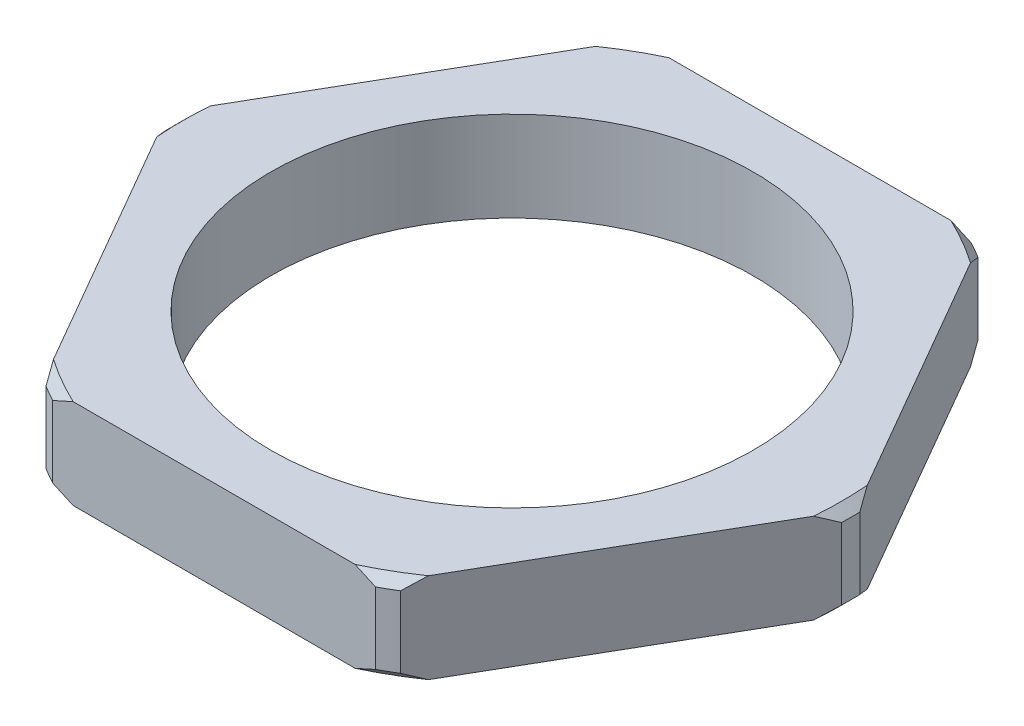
ISO-10303-21;
HEADER;
FILE_DESCRIPTION(('STEP AP214'),'2;1');
FILE_NAME('part.step','',(''),(''),'','','');
FILE_SCHEMA(('AUTOMOTIVE_DESIGN { 1 0 10303 214 1 1 1 1 }'));
ENDSEC;
DATA;
#1=APPLICATION_CONTEXT('core data for automotive mechanical design processes');
#2=APPLICATION_PROTOCOL_DEFINITION('international standard','automotive_design',2000,#1);
#3=PRODUCT_CONTEXT('',#1,'mechanical');
#4=PRODUCT('Part','Part','',(#3));
#5=PRODUCT_RELATED_PRODUCT_CATEGORY('part','',(#4));
#6=PRODUCT_DEFINITION_FORMATION('','',#4);
#7=PRODUCT_DEFINITION_CONTEXT('part definition',#1,'design');
#8=PRODUCT_DEFINITION('design','',#6,#7);
#9=PRODUCT_DEFINITION_SHAPE('','',#8);
#10=(LENGTH_UNIT() NAMED_UNIT(*) SI_UNIT(.MILLI.,.METRE.));
#11=(NAMED_UNIT(*) PLANE_ANGLE_UNIT() SI_UNIT($,.RADIAN.));
#12=(NAMED_UNIT(*) SI_UNIT($,.STERADIAN.) SOLID_ANGLE_UNIT());
#13=UNCERTAINTY_MEASURE_WITH_UNIT(LENGTH_MEASURE(1.E-05),#10,'distance_accuracy_value','');
#14=(GEOMETRIC_REPRESENTATION_CONTEXT(3) GLOBAL_UNCERTAINTY_ASSIGNED_CONTEXT((#13)) GLOBAL_UNIT_ASSIGNED_CONTEXT((#10,
#11,#12)) REPRESENTATION_CONTEXT('',''));
#15=CARTESIAN_POINT('',(0.,0.,0.));
#16=DIRECTION('',(0.,0.,1.));
#17=DIRECTION('',(1.,0.,0.));
#18=AXIS2_PLACEMENT_3D('',#15,#16,#17);
#19=CARTESIAN_POINT('',(0.,0.514706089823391,0.));
#20=DIRECTION('',(0.,1.,0.));
#21=DIRECTION('',(-1.,0.,0.));
#22=AXIS2_PLACEMENT_3D('',#19,#20,#21);
#23=CONICAL_SURFACE('',#22,18.825,0.78539816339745);
#24=CARTESIAN_POINT('',(18.8182004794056,0.514706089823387,0.505920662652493));
#25=CARTESIAN_POINT('',(18.7712355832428,0.469944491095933,0.587266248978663));
#26=CARTESIAN_POINT('',(18.7241650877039,0.42562525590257,0.66879473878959));
#27=CARTESIAN_POINT('',(18.6298148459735,0.337912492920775,0.832214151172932));
#28=CARTESIAN_POINT('',(18.5825351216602,0.294518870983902,0.914105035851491));
#29=CARTESIAN_POINT('',(18.4877585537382,0.208688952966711,1.07826286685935));
#30=CARTESIAN_POINT('',(18.4402617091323,0.166252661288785,1.16052981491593));
#31=CARTESIAN_POINT('',(18.3450438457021,0.0823717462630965,1.32545199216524));
#32=CARTESIAN_POINT('',(18.2973228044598,0.0409272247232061,1.40810726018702));
#33=CARTESIAN_POINT('',(18.2494908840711,0.,1.49095457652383));
#34=B_SPLINE_CURVE_WITH_KNOTS('',3,(#24,#25,#26,#27,#28,#29,#30,#31,#32,#33),.UNSPECIFIED.,.F.,
.F.,(4,2,2,2,4),(0.,0.312149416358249,0.624266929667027,0.936385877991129,1.24853672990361),.UNSPECIFIED.);
#35=CARTESIAN_POINT('',(18.8182004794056,0.514706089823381,0.505920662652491));
#36=VERTEX_POINT('',#35);
#37=CARTESIAN_POINT('',(18.2494908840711,0.,1.49095457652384));
#38=VERTEX_POINT('',#37);
#39=EDGE_CURVE('E189',#36,#38,#34,.T.);
#40=ORIENTED_EDGE('',*,*,#39,.T.);
#41=CARTESIAN_POINT('',(0.,0.,0.));
#42=DIRECTION('',(0.,1.,0.));
#43=DIRECTION('',(-1.,0.,0.));
#44=AXIS2_PLACEMENT_3D('',#41,#42,#43);
#45=CIRCLE('',#44,18.3102939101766);
#46=CARTESIAN_POINT('',(18.2494908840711,0.,-1.4909545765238));
#47=VERTEX_POINT('',#46);
#48=EDGE_CURVE('E187',#38,#47,#45,.T.);
#49=ORIENTED_EDGE('',*,*,#48,.T.);
#50=CARTESIAN_POINT('',(18.2494908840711,0.,-1.49095457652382));
#51=CARTESIAN_POINT('',(18.2973228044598,0.0409272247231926,-1.408107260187));
#52=CARTESIAN_POINT('',(18.3450438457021,0.0823717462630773,-1.32545199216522));
#53=CARTESIAN_POINT('',(18.4402617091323,0.166252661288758,-1.16052981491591));
#54=CARTESIAN_POINT('',(18.4877585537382,0.208688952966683,-1.07826286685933));
#55=CARTESIAN_POINT('',(18.5825351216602,0.294518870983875,-0.914105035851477));
#56=CARTESIAN_POINT('',(18.6298148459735,0.337912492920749,-0.832214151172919));
#57=CARTESIAN_POINT('',(18.7241650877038,0.425625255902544,-0.668794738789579));
#58=CARTESIAN_POINT('',(18.7712355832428,0.469944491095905,-0.587266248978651));
#59=CARTESIAN_POINT('',(18.8182004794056,0.514706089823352,-0.505920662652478));
#60=B_SPLINE_CURVE_WITH_KNOTS('',3,(#50,#51,#52,#53,#54,#55,#56,#57,#58,#59),.UNSPECIFIED.,.F.,
.F.,(4,2,2,2,4),(0.,0.312150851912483,0.624269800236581,0.936387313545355,1.2485367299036),.UNSPECIFIED.);
#61=CARTESIAN_POINT('',(18.8182004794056,0.514706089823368,-0.505920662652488));
#62=VERTEX_POINT('',#61);
#63=EDGE_CURVE('E21',#47,#62,#60,.T.);
#64=ORIENTED_EDGE('',*,*,#63,.T.);
#65=CARTESIAN_POINT('',(0.,0.514706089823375,0.));
#66=DIRECTION('',(0.,1.,0.));
#67=DIRECTION('',(0.,0.,1.));
#68=AXIS2_PLACEMENT_3D('',#65,#66,#67);
#69=CIRCLE('',#68,18.825);
#70=EDGE_CURVE('E184',#36,#62,#69,.T.);
#71=ORIENTED_EDGE('',*,*,#70,.F.);
#72=EDGE_LOOP('',(#40,#49,#64,#71));
#73=FACE_BOUND('',#72,.T.);
#74=ADVANCED_FACE('F17',(#73),#23,.T.);
#75=CARTESIAN_POINT('',(0.,0.514706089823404,0.));
#76=DIRECTION('',(0.,1.,0.));
#77=DIRECTION('',(0.,0.,1.));
#78=AXIS2_PLACEMENT_3D('',#75,#76,#77);
#79=CONICAL_SURFACE('',#78,18.825,0.785398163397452);
#80=CARTESIAN_POINT('',(9.84724038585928,0.514706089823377,-16.0440793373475));
#81=CARTESIAN_POINT('',(9.89420528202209,0.469944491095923,-15.9627337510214));
#82=CARTESIAN_POINT('',(9.94127577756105,0.425625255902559,-15.8812052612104));
#83=CARTESIAN_POINT('',(10.0356260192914,0.33791249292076,-15.7177858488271));
#84=CARTESIAN_POINT('',(10.0829057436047,0.294518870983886,-15.6358949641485));
#85=CARTESIAN_POINT('',(10.1776823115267,0.208688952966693,-15.4717371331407));
#86=CARTESIAN_POINT('',(10.2251791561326,0.166252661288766,-15.3894701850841));
#87=CARTESIAN_POINT('',(10.3203970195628,0.0823717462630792,-15.2245480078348));
#88=CARTESIAN_POINT('',(10.3681180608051,0.0409272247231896,-15.141892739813));
#89=CARTESIAN_POINT('',(10.4159499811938,0.,-15.0590454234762));
#90=B_SPLINE_CURVE_WITH_KNOTS('',3,(#80,#81,#82,#83,#84,#85,#86,#87,#88,#89),.UNSPECIFIED.,.F.,
.F.,(4,2,2,2,4),(0.,0.312149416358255,0.624266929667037,0.936385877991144,1.24853672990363),.UNSPECIFIED.);
#91=CARTESIAN_POINT('',(9.84724038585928,0.514706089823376,-16.0440793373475));
#92=VERTEX_POINT('',#91);
#93=CARTESIAN_POINT('',(10.4159499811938,0.,-15.0590454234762));
#94=VERTEX_POINT('',#93);
#95=EDGE_CURVE('E426',#92,#94,#90,.T.);
#96=ORIENTED_EDGE('',*,*,#95,.T.);
#97=CARTESIAN_POINT('',(0.,0.,0.));
#98=DIRECTION('',(0.,1.,0.));
#99=DIRECTION('',(0.,0.,1.));
#100=AXIS2_PLACEMENT_3D('',#97,#98,#99);
#101=CIRCLE('',#100,18.3102939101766);
#102=CARTESIAN_POINT('',(7.8335409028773,0.,-16.5499999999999));
#103=VERTEX_POINT('',#102);
#104=EDGE_CURVE('E479',#94,#103,#101,.T.);
#105=ORIENTED_EDGE('',*,*,#104,.T.);
#106=CARTESIAN_POINT('',(7.83354090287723,0.,-16.5499999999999));
#107=CARTESIAN_POINT('',(7.92920474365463,0.0409272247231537,-16.5499999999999));
#108=CARTESIAN_POINT('',(8.02464682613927,0.0823717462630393,-16.5499999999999));
#109=CARTESIAN_POINT('',(8.21508255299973,0.166252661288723,-16.5499999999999));
#110=CARTESIAN_POINT('',(8.31007624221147,0.208688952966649,-16.5499999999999));
#111=CARTESIAN_POINT('',(8.49962937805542,0.294518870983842,-16.5499999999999));
#112=CARTESIAN_POINT('',(8.5941888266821,0.337912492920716,-16.5499999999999));
#113=CARTESIAN_POINT('',(8.78288931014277,0.425625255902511,-16.5499999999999));
#114=CARTESIAN_POINT('',(8.8770303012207,0.469944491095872,-16.5499999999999));
#115=CARTESIAN_POINT('',(8.97096009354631,0.514706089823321,-16.5499999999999));
#116=B_SPLINE_CURVE_WITH_KNOTS('',3,(#106,#107,#108,#109,#110,#111,#112,#113,#114,#115),
.UNSPECIFIED.,.F.,.F.,(4,2,2,2,4),(0.,0.312150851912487,0.62426980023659,0.93638731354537,
1.24853672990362),.UNSPECIFIED.);
#117=CARTESIAN_POINT('',(8.97096009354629,0.514706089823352,-16.5499999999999));
#118=VERTEX_POINT('',#117);
#119=EDGE_CURVE('E430',#103,#118,#116,.T.);
#120=ORIENTED_EDGE('',*,*,#119,.T.);
#121=CARTESIAN_POINT('',(0.,0.514706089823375,0.));
#122=DIRECTION('',(0.,1.,0.));
#123=DIRECTION('',(0.,0.,1.));
#124=AXIS2_PLACEMENT_3D('',#121,#122,#123);
#125=CIRCLE('',#124,18.825);
#126=EDGE_CURVE('E197',#92,#118,#125,.T.);
#127=ORIENTED_EDGE('',*,*,#126,.F.);
#128=EDGE_LOOP('',(#96,#105,#120,#127));
#129=FACE_BOUND('',#128,.T.);
#130=ADVANCED_FACE('F434',(#129),#79,.T.);
#131=CARTESIAN_POINT('',(0.,0.514706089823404,0.));
#132=DIRECTION('',(0.,1.,0.));
#133=DIRECTION('',(0.,0.,1.));
#134=AXIS2_PLACEMENT_3D('',#131,#132,#133);
#135=CONICAL_SURFACE('',#134,18.825,0.785398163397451);
#136=CARTESIAN_POINT('',(-8.97096009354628,0.51470608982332,-16.5499999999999));
#137=CARTESIAN_POINT('',(-8.87703030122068,0.469944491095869,-16.5499999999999));
#138=CARTESIAN_POINT('',(-8.78288931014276,0.425625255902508,-16.5499999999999));
#139=CARTESIAN_POINT('',(-8.5941888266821,0.337912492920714,-16.5499999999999));
#140=CARTESIAN_POINT('',(-8.49962937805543,0.294518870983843,-16.5499999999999));
#141=CARTESIAN_POINT('',(-8.31007624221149,0.208688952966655,-16.5499999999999));
#142=CARTESIAN_POINT('',(-8.21508255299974,0.166252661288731,-16.5499999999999));
#143=CARTESIAN_POINT('',(-8.0246468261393,0.0823717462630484,-16.5499999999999));
#144=CARTESIAN_POINT('',(-7.92920474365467,0.0409272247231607,-16.5499999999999));
#145=CARTESIAN_POINT('',(-7.83354090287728,0.,-16.5499999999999));
#146=B_SPLINE_CURVE_WITH_KNOTS('',3,(#136,#137,#138,#139,#140,#141,#142,#143,#144,#145),
.UNSPECIFIED.,.F.,.F.,(4,2,2,2,4),(0.,0.312149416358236,0.624266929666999,0.936385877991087,
1.24853672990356),.UNSPECIFIED.);
#147=CARTESIAN_POINT('',(-8.97096009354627,0.514706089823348,-16.5499999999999));
#148=VERTEX_POINT('',#147);
#149=CARTESIAN_POINT('',(-7.83354090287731,0.,-16.5499999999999));
#150=VERTEX_POINT('',#149);
#151=EDGE_CURVE('E376',#148,#150,#146,.T.);
#152=ORIENTED_EDGE('',*,*,#151,.T.);
#153=CARTESIAN_POINT('',(0.,0.,0.));
#154=DIRECTION('',(0.,1.,0.));
#155=DIRECTION('',(0.,0.,1.));
#156=AXIS2_PLACEMENT_3D('',#153,#154,#155);
#157=CIRCLE('',#156,18.3102939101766);
#158=CARTESIAN_POINT('',(-10.4159499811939,0.,-15.0590454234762));
#159=VERTEX_POINT('',#158);
#160=EDGE_CURVE('E476',#150,#159,#157,.T.);
#161=ORIENTED_EDGE('',*,*,#160,.T.);
#162=CARTESIAN_POINT('',(-10.4159499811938,0.,-15.0590454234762));
#163=CARTESIAN_POINT('',(-10.3681180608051,0.0409272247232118,-15.141892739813));
#164=CARTESIAN_POINT('',(-10.3203970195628,0.0823717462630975,-15.2245480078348));
#165=CARTESIAN_POINT('',(-10.2251791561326,0.166252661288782,-15.3894701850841));
#166=CARTESIAN_POINT('',(-10.1776823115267,0.20868895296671,-15.4717371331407));
#167=CARTESIAN_POINT('',(-10.0829057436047,0.294518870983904,-15.6358949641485));
#168=CARTESIAN_POINT('',(-10.0356260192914,0.337912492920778,-15.7177858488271));
#169=CARTESIAN_POINT('',(-9.94127577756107,0.425625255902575,-15.8812052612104));
#170=CARTESIAN_POINT('',(-9.89420528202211,0.469944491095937,-15.9627337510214));
#171=CARTESIAN_POINT('',(-9.8472403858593,0.514706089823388,-16.0440793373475));
#172=B_SPLINE_CURVE_WITH_KNOTS('',3,(#162,#163,#164,#165,#166,#167,#168,#169,#170,#171),
.UNSPECIFIED.,.F.,.F.,(4,2,2,2,4),(0.,0.31215085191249,0.624269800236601,0.936387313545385,
1.24853672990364),.UNSPECIFIED.);
#173=CARTESIAN_POINT('',(-9.8472403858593,0.514706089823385,-16.0440793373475));
#174=VERTEX_POINT('',#173);
#175=EDGE_CURVE('E382',#159,#174,#172,.T.);
#176=ORIENTED_EDGE('',*,*,#175,.T.);
#177=CARTESIAN_POINT('',(0.,0.514706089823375,0.));
#178=DIRECTION('',(0.,1.,0.));
#179=DIRECTION('',(0.,0.,1.));
#180=AXIS2_PLACEMENT_3D('',#177,#178,#179);
#181=CIRCLE('',#180,18.825);
#182=EDGE_CURVE('E240',#148,#174,#181,.T.);
#183=ORIENTED_EDGE('',*,*,#182,.F.);
#184=EDGE_LOOP('',(#152,#161,#176,#183));
#185=FACE_BOUND('',#184,.T.);
#186=ADVANCED_FACE('F364',(#185),#135,.T.);
#187=CARTESIAN_POINT('',(0.,0.514706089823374,0.));
#188=DIRECTION('',(0.,1.,0.));
#189=DIRECTION('',(0.,0.,1.));
#190=AXIS2_PLACEMENT_3D('',#187,#188,#189);
#191=CONICAL_SURFACE('',#190,18.825,0.78539816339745);
#192=CARTESIAN_POINT('',(-18.8182004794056,0.514706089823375,-0.505920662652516));
#193=CARTESIAN_POINT('',(-18.7712355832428,0.469944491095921,-0.587266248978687));
#194=CARTESIAN_POINT('',(-18.7241650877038,0.425625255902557,-0.668794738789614));
#195=CARTESIAN_POINT('',(-18.6298148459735,0.337912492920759,-0.832214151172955));
#196=CARTESIAN_POINT('',(-18.5825351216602,0.294518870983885,-0.914105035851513));
#197=CARTESIAN_POINT('',(-18.4877585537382,0.208688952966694,-1.07826286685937));
#198=CARTESIAN_POINT('',(-18.4402617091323,0.166252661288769,-1.16052981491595));
#199=CARTESIAN_POINT('',(-18.3450438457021,0.0823717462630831,-1.32545199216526));
#200=CARTESIAN_POINT('',(-18.2973228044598,0.0409272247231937,-1.40810726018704));
#201=CARTESIAN_POINT('',(-18.2494908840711,0.,-1.49095457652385));
#202=B_SPLINE_CURVE_WITH_KNOTS('',3,(#192,#193,#194,#195,#196,#197,#198,#199,#200,#201),
.UNSPECIFIED.,.F.,.F.,(4,2,2,2,4),(0.,0.312149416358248,0.624266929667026,0.93638587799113,
1.24853672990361),.UNSPECIFIED.);
#203=CARTESIAN_POINT('',(-18.8182004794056,0.514706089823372,-0.505920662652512));
#204=VERTEX_POINT('',#203);
#205=CARTESIAN_POINT('',(-18.2494908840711,0.,-1.49095457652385));
#206=VERTEX_POINT('',#205);
#207=EDGE_CURVE('E266',#204,#206,#202,.T.);
#208=ORIENTED_EDGE('',*,*,#207,.T.);
#209=CARTESIAN_POINT('',(0.,0.,0.));
#210=DIRECTION('',(0.,1.,0.));
#211=DIRECTION('',(0.,0.,1.));
#212=AXIS2_PLACEMENT_3D('',#209,#210,#211);
#213=CIRCLE('',#212,18.3102939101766);
#214=CARTESIAN_POINT('',(-18.2494908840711,0.,1.49095457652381));
#215=VERTEX_POINT('',#214);
#216=EDGE_CURVE('E473',#206,#215,#213,.T.);
#217=ORIENTED_EDGE('',*,*,#216,.T.);
#218=CARTESIAN_POINT('',(-18.2494908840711,0.,1.49095457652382));
#219=CARTESIAN_POINT('',(-18.2973228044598,0.0409272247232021,1.40810726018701));
#220=CARTESIAN_POINT('',(-18.3450438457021,0.082371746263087,1.32545199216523));
#221=CARTESIAN_POINT('',(-18.4402617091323,0.166252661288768,1.16052981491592));
#222=CARTESIAN_POINT('',(-18.4877585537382,0.208688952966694,1.07826286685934));
#223=CARTESIAN_POINT('',(-18.5825351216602,0.294518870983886,0.914105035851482));
#224=CARTESIAN_POINT('',(-18.6298148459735,0.33791249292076,0.832214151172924));
#225=CARTESIAN_POINT('',(-18.7241650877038,0.425625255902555,0.668794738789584));
#226=CARTESIAN_POINT('',(-18.7712355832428,0.469944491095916,0.587266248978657));
#227=CARTESIAN_POINT('',(-18.8182004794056,0.514706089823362,0.505920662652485));
#228=B_SPLINE_CURVE_WITH_KNOTS('',3,(#218,#219,#220,#221,#222,#223,#224,#225,#226,#227),
.UNSPECIFIED.,.F.,.F.,(4,2,2,2,4),(0.,0.312150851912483,0.624269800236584,0.936387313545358,
1.2485367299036),.UNSPECIFIED.);
#229=CARTESIAN_POINT('',(-18.8182004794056,0.51470608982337,0.505920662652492));
#230=VERTEX_POINT('',#229);
#231=EDGE_CURVE('E267',#215,#230,#228,.T.);
#232=ORIENTED_EDGE('',*,*,#231,.T.);
#233=CARTESIAN_POINT('',(0.,0.514706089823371,0.));
#234=DIRECTION('',(0.,1.,0.));
#235=DIRECTION('',(0.,0.,1.));
#236=AXIS2_PLACEMENT_3D('',#233,#234,#235);
#237=CIRCLE('',#236,18.825);
#238=EDGE_CURVE('E264',#230,#204,#237,.F.);
#239=ORIENTED_EDGE('',*,*,#238,.T.);
#240=EDGE_LOOP('',(#208,#217,#232,#239));
#241=FACE_BOUND('',#240,.T.);
#242=ADVANCED_FACE('F356',(#241),#191,.T.);
#243=CARTESIAN_POINT('',(0.,0.514706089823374,0.));
#244=DIRECTION('',(0.,1.,0.));
#245=DIRECTION('',(0.,0.,1.));
#246=AXIS2_PLACEMENT_3D('',#243,#244,#245);
#247=CONICAL_SURFACE('',#246,18.825,0.785398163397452);
#248=CARTESIAN_POINT('',(-9.84724038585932,0.51470608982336,16.0440793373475));
#249=CARTESIAN_POINT('',(-9.89420528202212,0.469944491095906,15.9627337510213));
#250=CARTESIAN_POINT('',(-9.94127577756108,0.425625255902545,15.8812052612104));
#251=CARTESIAN_POINT('',(-10.0356260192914,0.337912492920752,15.7177858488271));
#252=CARTESIAN_POINT('',(-10.0829057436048,0.294518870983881,15.6358949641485));
#253=CARTESIAN_POINT('',(-10.1776823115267,0.208688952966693,15.4717371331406));
#254=CARTESIAN_POINT('',(-10.2251791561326,0.166252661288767,15.3894701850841));
#255=CARTESIAN_POINT('',(-10.3203970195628,0.082371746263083,15.2245480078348));
#256=CARTESIAN_POINT('',(-10.3681180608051,0.0409272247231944,15.141892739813));
#257=CARTESIAN_POINT('',(-10.4159499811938,0.,15.0590454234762));
#258=B_SPLINE_CURVE_WITH_KNOTS('',3,(#248,#249,#250,#251,#252,#253,#254,#255,#256,#257),
.UNSPECIFIED.,.F.,.F.,(4,2,2,2,4),(0.,0.312149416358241,0.624266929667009,0.936385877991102,
1.24853672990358),.UNSPECIFIED.);
#259=CARTESIAN_POINT('',(-9.84724038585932,0.514706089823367,16.0440793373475));
#260=VERTEX_POINT('',#259);
#261=CARTESIAN_POINT('',(-10.4159499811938,0.,15.0590454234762));
#262=VERTEX_POINT('',#261);
#263=EDGE_CURVE('E332',#260,#262,#258,.T.);
#264=ORIENTED_EDGE('',*,*,#263,.T.);
#265=CARTESIAN_POINT('',(0.,0.,0.));
#266=DIRECTION('',(0.,1.,0.));
#267=DIRECTION('',(0.,0.,1.));
#268=AXIS2_PLACEMENT_3D('',#265,#266,#267);
#269=CIRCLE('',#268,18.3102939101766);
#270=CARTESIAN_POINT('',(-7.83354090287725,0.,16.55));
#271=VERTEX_POINT('',#270);
#272=EDGE_CURVE('E463',#262,#271,#269,.T.);
#273=ORIENTED_EDGE('',*,*,#272,.T.);
#274=CARTESIAN_POINT('',(-7.83354090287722,0.,16.55));
#275=CARTESIAN_POINT('',(-7.92920474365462,0.0409272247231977,16.55));
#276=CARTESIAN_POINT('',(-8.02464682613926,0.082371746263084,16.55));
#277=CARTESIAN_POINT('',(-8.21508255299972,0.166252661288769,16.55));
#278=CARTESIAN_POINT('',(-8.31007624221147,0.208688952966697,16.55));
#279=CARTESIAN_POINT('',(-8.49962937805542,0.294518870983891,16.55));
#280=CARTESIAN_POINT('',(-8.5941888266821,0.337912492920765,16.55));
#281=CARTESIAN_POINT('',(-8.78288931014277,0.425625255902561,16.55));
#282=CARTESIAN_POINT('',(-8.8770303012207,0.469944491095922,16.55));
#283=CARTESIAN_POINT('',(-8.97096009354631,0.514706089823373,16.55));
#284=B_SPLINE_CURVE_WITH_KNOTS('',3,(#274,#275,#276,#277,#278,#279,#280,#281,#282,#283),
.UNSPECIFIED.,.F.,.F.,(4,2,2,2,4),(0.,0.312150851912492,0.624269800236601,0.936387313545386,
1.24853672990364),.UNSPECIFIED.);
#285=CARTESIAN_POINT('',(-8.97096009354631,0.514706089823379,16.55));
#286=VERTEX_POINT('',#285);
#287=EDGE_CURVE('E340',#271,#286,#284,.T.);
#288=ORIENTED_EDGE('',*,*,#287,.T.);
#289=CARTESIAN_POINT('',(0.,0.514706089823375,0.));
#290=DIRECTION('',(0.,1.,0.));
#291=DIRECTION('',(0.,0.,1.));
#292=AXIS2_PLACEMENT_3D('',#289,#290,#291);
#293=CIRCLE('',#292,18.825);
#294=EDGE_CURVE('E239',#260,#286,#293,.T.);
#295=ORIENTED_EDGE('',*,*,#294,.F.);
#296=EDGE_LOOP('',(#264,#273,#288,#295));
#297=FACE_BOUND('',#296,.T.);
#298=ADVANCED_FACE('F351',(#297),#247,.T.);
#299=CARTESIAN_POINT('',(0.,0.514706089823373,0.));
#300=DIRECTION('',(0.,1.,0.));
#301=DIRECTION('',(0.,0.,1.));
#302=AXIS2_PLACEMENT_3D('',#299,#300,#301);
#303=CONICAL_SURFACE('',#302,18.825,0.785398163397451);
#304=CARTESIAN_POINT('',(8.97096009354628,0.51470608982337,16.55));
#305=CARTESIAN_POINT('',(8.87703030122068,0.469944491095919,16.55));
#306=CARTESIAN_POINT('',(8.78288931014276,0.425625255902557,16.55));
#307=CARTESIAN_POINT('',(8.5941888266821,0.337912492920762,16.55));
#308=CARTESIAN_POINT('',(8.49962937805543,0.29451887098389,16.55));
#309=CARTESIAN_POINT('',(8.31007624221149,0.208688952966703,16.55));
#310=CARTESIAN_POINT('',(8.21508255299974,0.166252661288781,16.55));
#311=CARTESIAN_POINT('',(8.0246468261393,0.0823717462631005,16.55));
#312=CARTESIAN_POINT('',(7.92920474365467,0.0409272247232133,16.55));
#313=CARTESIAN_POINT('',(7.83354090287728,0.,16.55));
#314=B_SPLINE_CURVE_WITH_KNOTS('',3,(#304,#305,#306,#307,#308,#309,#310,#311,#312,#313),
.UNSPECIFIED.,.F.,.F.,(4,2,2,2,4),(0.,0.312149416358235,0.624266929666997,0.936385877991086,
1.24853672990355),.UNSPECIFIED.);
#315=CARTESIAN_POINT('',(8.97096009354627,0.514706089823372,16.55));
#316=VERTEX_POINT('',#315);
#317=CARTESIAN_POINT('',(7.83354090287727,0.,16.55));
#318=VERTEX_POINT('',#317);
#319=EDGE_CURVE('E261',#316,#318,#314,.T.);
#320=ORIENTED_EDGE('',*,*,#319,.T.);
#321=CARTESIAN_POINT('',(0.,0.,0.));
#322=DIRECTION('',(0.,1.,0.));
#323=DIRECTION('',(0.,0.,1.));
#324=AXIS2_PLACEMENT_3D('',#321,#322,#323);
#325=CIRCLE('',#324,18.3102939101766);
#326=CARTESIAN_POINT('',(10.4159499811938,0.,15.0590454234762));
#327=VERTEX_POINT('',#326);
#328=EDGE_CURVE('E460',#318,#327,#325,.T.);
#329=ORIENTED_EDGE('',*,*,#328,.T.);
#330=CARTESIAN_POINT('',(10.4159499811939,0.,15.0590454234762));
#331=CARTESIAN_POINT('',(10.3681180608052,0.0409272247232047,15.141892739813));
#332=CARTESIAN_POINT('',(10.3203970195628,0.082371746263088,15.2245480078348));
#333=CARTESIAN_POINT('',(10.2251791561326,0.166252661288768,15.3894701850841));
#334=CARTESIAN_POINT('',(10.1776823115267,0.208688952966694,15.4717371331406));
#335=CARTESIAN_POINT('',(10.0829057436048,0.294518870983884,15.6358949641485));
#336=CARTESIAN_POINT('',(10.0356260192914,0.337912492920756,15.7177858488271));
#337=CARTESIAN_POINT('',(9.9412757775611,0.425625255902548,15.8812052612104));
#338=CARTESIAN_POINT('',(9.89420528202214,0.469944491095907,15.9627337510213));
#339=CARTESIAN_POINT('',(9.84724038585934,0.514706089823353,16.0440793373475));
#340=B_SPLINE_CURVE_WITH_KNOTS('',3,(#330,#331,#332,#333,#334,#335,#336,#337,#338,#339),
.UNSPECIFIED.,.F.,.F.,(4,2,2,2,4),(0.,0.312150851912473,0.624269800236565,0.936387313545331,
1.24853672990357),.UNSPECIFIED.);
#341=CARTESIAN_POINT('',(9.84724038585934,0.514706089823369,16.0440793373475));
#342=VERTEX_POINT('',#341);
#343=EDGE_CURVE('E339',#327,#342,#340,.T.);
#344=ORIENTED_EDGE('',*,*,#343,.T.);
#345=CARTESIAN_POINT('',(0.,0.514706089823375,0.));
#346=DIRECTION('',(0.,1.,0.));
#347=DIRECTION('',(0.,0.,1.));
#348=AXIS2_PLACEMENT_3D('',#345,#346,#347);
#349=CIRCLE('',#348,18.825);
#350=EDGE_CURVE('E198',#316,#342,#349,.T.);
#351=ORIENTED_EDGE('',*,*,#350,.F.);
#352=EDGE_LOOP('',(#320,#329,#344,#351));
#353=FACE_BOUND('',#352,.T.);
#354=ADVANCED_FACE('F355',(#353),#303,.T.);
#355=CARTESIAN_POINT('',(0.,-5.,0.));
#356=DIRECTION('',(0.,1.,0.));
#357=DIRECTION('',(0.,0.,1.));
#358=AXIS2_PLACEMENT_3D('',#355,#356,#357);
#359=CYLINDRICAL_SURFACE('',#358,18.825);
#360=DIRECTION('',(0.,1.,0.));
#361=VECTOR('',#360,1.);
#362=CARTESIAN_POINT('',(8.97096009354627,5.,16.55));
#363=LINE('',#362,#361);
#364=CARTESIAN_POINT('',(8.97096009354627,4.48529391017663,16.55));
#365=VERTEX_POINT('',#364);
#366=EDGE_CURVE('E233',#365,#316,#363,.F.);
#367=ORIENTED_EDGE('',*,*,#366,.T.);
#368=ORIENTED_EDGE('',*,*,#350,.T.);
#369=DIRECTION('',(0.,1.,0.));
#370=VECTOR('',#369,1.);
#371=CARTESIAN_POINT('',(9.84724038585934,5.,16.0440793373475));
#372=LINE('',#371,#370);
#373=CARTESIAN_POINT('',(9.84724038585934,4.48529391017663,16.0440793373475));
#374=VERTEX_POINT('',#373);
#375=EDGE_CURVE('E217',#342,#374,#372,.T.);
#376=ORIENTED_EDGE('',*,*,#375,.T.);
#377=CARTESIAN_POINT('',(0.,4.48529391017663,0.));
#378=DIRECTION('',(0.,-1.,0.));
#379=DIRECTION('',(0.,0.,-1.));
#380=AXIS2_PLACEMENT_3D('',#377,#378,#379);
#381=CIRCLE('',#380,18.825);
#382=EDGE_CURVE('E262',#365,#374,#381,.F.);
#383=ORIENTED_EDGE('',*,*,#382,.F.);
#384=EDGE_LOOP('',(#367,#368,#376,#383));
#385=FACE_BOUND('',#384,.T.);
#386=ADVANCED_FACE('F492',(#385),#359,.T.);
#387=CARTESIAN_POINT('',(0.,-5.,0.));
#388=DIRECTION('',(0.,1.,0.));
#389=DIRECTION('',(0.,0.,1.));
#390=AXIS2_PLACEMENT_3D('',#387,#388,#389);
#391=CYLINDRICAL_SURFACE('',#390,18.825);
#392=DIRECTION('',(0.,1.,0.));
#393=VECTOR('',#392,1.);
#394=CARTESIAN_POINT('',(18.8182004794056,5.,0.505920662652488));
#395=LINE('',#394,#393);
#396=CARTESIAN_POINT('',(18.8182004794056,4.48529391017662,0.50592066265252));
#397=VERTEX_POINT('',#396);
#398=EDGE_CURVE('E196',#397,#36,#395,.F.);
#399=ORIENTED_EDGE('',*,*,#398,.T.);
#400=ORIENTED_EDGE('',*,*,#70,.T.);
#401=DIRECTION('',(0.,1.,0.));
#402=VECTOR('',#401,1.);
#403=CARTESIAN_POINT('',(18.8182004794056,5.,-0.505920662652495));
#404=LINE('',#403,#402);
#405=CARTESIAN_POINT('',(18.8182004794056,4.48529391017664,-0.505920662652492));
#406=VERTEX_POINT('',#405);
#407=EDGE_CURVE('E194',#62,#406,#404,.T.);
#408=ORIENTED_EDGE('',*,*,#407,.T.);
#409=CARTESIAN_POINT('',(0.,4.48529391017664,0.));
#410=DIRECTION('',(0.,-1.,0.));
#411=DIRECTION('',(0.,0.,-1.));
#412=AXIS2_PLACEMENT_3D('',#409,#410,#411);
#413=CIRCLE('',#412,18.825);
#414=EDGE_CURVE('E257',#397,#406,#413,.F.);
#415=ORIENTED_EDGE('',*,*,#414,.F.);
#416=EDGE_LOOP('',(#399,#400,#408,#415));
#417=FACE_BOUND('',#416,.T.);
#418=ADVANCED_FACE('F192',(#417),#391,.T.);
#419=CARTESIAN_POINT('',(0.,-5.,0.));
#420=DIRECTION('',(0.,1.,0.));
#421=DIRECTION('',(0.,0.,1.));
#422=AXIS2_PLACEMENT_3D('',#419,#420,#421);
#423=CYLINDRICAL_SURFACE('',#422,18.825);
#424=DIRECTION('',(0.,1.,0.));
#425=VECTOR('',#424,1.);
#426=CARTESIAN_POINT('',(9.84724038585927,5.,-16.0440793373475));
#427=LINE('',#426,#425);
#428=CARTESIAN_POINT('',(9.84724038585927,4.4852939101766,-16.0440793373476));
#429=VERTEX_POINT('',#428);
#430=EDGE_CURVE('E209',#429,#92,#427,.F.);
#431=ORIENTED_EDGE('',*,*,#430,.T.);
#432=ORIENTED_EDGE('',*,*,#126,.T.);
#433=DIRECTION('',(0.,1.,0.));
#434=VECTOR('',#433,1.);
#435=CARTESIAN_POINT('',(8.97096009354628,5.,-16.5499999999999));
#436=LINE('',#435,#434);
#437=CARTESIAN_POINT('',(8.97096009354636,4.48529391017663,-16.5499999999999));
#438=VERTEX_POINT('',#437);
#439=EDGE_CURVE('E539',#118,#438,#436,.T.);
#440=ORIENTED_EDGE('',*,*,#439,.T.);
#441=CARTESIAN_POINT('',(0.,4.48529391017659,0.));
#442=DIRECTION('',(0.,-1.,0.));
#443=DIRECTION('',(0.,0.,-1.));
#444=AXIS2_PLACEMENT_3D('',#441,#442,#443);
#445=CIRCLE('',#444,18.825);
#446=EDGE_CURVE('E207',#429,#438,#445,.F.);
#447=ORIENTED_EDGE('',*,*,#446,.F.);
#448=EDGE_LOOP('',(#431,#432,#440,#447));
#449=FACE_BOUND('',#448,.T.);
#450=ADVANCED_FACE('F537',(#449),#423,.T.);
#451=CARTESIAN_POINT('',(0.,-5.,0.));
#452=DIRECTION('',(0.,1.,0.));
#453=DIRECTION('',(0.,0.,1.));
#454=AXIS2_PLACEMENT_3D('',#451,#452,#453);
#455=CYLINDRICAL_SURFACE('',#454,18.825);
#456=DIRECTION('',(0.,1.,0.));
#457=VECTOR('',#456,1.);
#458=CARTESIAN_POINT('',(-8.97096009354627,5.,-16.5499999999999));
#459=LINE('',#458,#457);
#460=CARTESIAN_POINT('',(-8.97096009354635,4.48529391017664,-16.5499999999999));
#461=VERTEX_POINT('',#460);
#462=EDGE_CURVE('E212',#461,#148,#459,.F.);
#463=ORIENTED_EDGE('',*,*,#462,.T.);
#464=ORIENTED_EDGE('',*,*,#182,.T.);
#465=DIRECTION('',(0.,1.,0.));
#466=VECTOR('',#465,1.);
#467=CARTESIAN_POINT('',(-9.8472403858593,5.,-16.0440793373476));
#468=LINE('',#467,#466);
#469=CARTESIAN_POINT('',(-9.8472403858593,4.48529391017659,-16.0440793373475));
#470=VERTEX_POINT('',#469);
#471=EDGE_CURVE('E552',#174,#470,#468,.T.);
#472=ORIENTED_EDGE('',*,*,#471,.T.);
#473=CARTESIAN_POINT('',(0.,4.48529391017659,0.));
#474=DIRECTION('',(0.,-1.,0.));
#475=DIRECTION('',(0.,0.,-1.));
#476=AXIS2_PLACEMENT_3D('',#473,#474,#475);
#477=CIRCLE('',#476,18.825);
#478=EDGE_CURVE('E249',#461,#470,#477,.F.);
#479=ORIENTED_EDGE('',*,*,#478,.F.);
#480=EDGE_LOOP('',(#463,#464,#472,#479));
#481=FACE_BOUND('',#480,.T.);
#482=ADVANCED_FACE('F591',(#481),#455,.T.);
#483=CARTESIAN_POINT('',(0.,-5.,0.));
#484=DIRECTION('',(0.,1.,0.));
#485=DIRECTION('',(0.,0.,1.));
#486=AXIS2_PLACEMENT_3D('',#483,#484,#485);
#487=CYLINDRICAL_SURFACE('',#486,18.825);
#488=DIRECTION('',(0.,1.,0.));
#489=VECTOR('',#488,1.);
#490=CARTESIAN_POINT('',(-9.84724038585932,5.,16.0440793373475));
#491=LINE('',#490,#489);
#492=CARTESIAN_POINT('',(-9.84724038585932,4.48529391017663,16.0440793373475));
#493=VERTEX_POINT('',#492);
#494=EDGE_CURVE('E555',#493,#260,#491,.F.);
#495=ORIENTED_EDGE('',*,*,#494,.T.);
#496=ORIENTED_EDGE('',*,*,#294,.T.);
#497=DIRECTION('',(0.,1.,0.));
#498=VECTOR('',#497,1.);
#499=CARTESIAN_POINT('',(-8.97096009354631,5.,16.55));
#500=LINE('',#499,#498);
#501=CARTESIAN_POINT('',(-8.9709600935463,4.48529391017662,16.55));
#502=VERTEX_POINT('',#501);
#503=EDGE_CURVE('E226',#286,#502,#500,.T.);
#504=ORIENTED_EDGE('',*,*,#503,.T.);
#505=CARTESIAN_POINT('',(0.,4.48529391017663,0.));
#506=DIRECTION('',(0.,1.,0.));
#507=DIRECTION('',(0.,0.,1.));
#508=AXIS2_PLACEMENT_3D('',#505,#506,#507);
#509=CIRCLE('',#508,18.825);
#510=EDGE_CURVE('E237',#502,#493,#509,.F.);
#511=ORIENTED_EDGE('',*,*,#510,.T.);
#512=EDGE_LOOP('',(#495,#496,#504,#511));
#513=FACE_BOUND('',#512,.T.);
#514=ADVANCED_FACE('F701',(#513),#487,.T.);
#515=CARTESIAN_POINT('',(19.1102939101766,0.,0.));
#516=DIRECTION('',(0.,1.,0.));
#517=DIRECTION('',(0.,0.,1.));
#518=AXIS2_PLACEMENT_3D('',#515,#516,#517);
#519=PLANE('',#518);
#520=DIRECTION('',(-1.,0.,0.));
#521=VECTOR('',#520,1.);
#522=CARTESIAN_POINT('',(-9.5551469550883,0.,16.55));
#523=LINE('',#522,#521);
#524=EDGE_CURVE('E230',#318,#271,#523,.T.);
#525=ORIENTED_EDGE('',*,*,#524,.T.);
#526=ORIENTED_EDGE('',*,*,#272,.F.);
#527=DIRECTION('',(-0.5,0.,-0.866025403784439));
#528=VECTOR('',#527,1.);
#529=CARTESIAN_POINT('',(-19.1102939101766,0.,0.));
#530=LINE('',#529,#528);
#531=EDGE_CURVE('E558',#262,#215,#530,.T.);
#532=ORIENTED_EDGE('',*,*,#531,.T.);
#533=ORIENTED_EDGE('',*,*,#216,.F.);
#534=DIRECTION('',(0.5,0.,-0.866025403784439));
#535=VECTOR('',#534,1.);
#536=CARTESIAN_POINT('',(-9.55514695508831,0.,-16.55));
#537=LINE('',#536,#535);
#538=EDGE_CURVE('E549',#206,#159,#537,.T.);
#539=ORIENTED_EDGE('',*,*,#538,.T.);
#540=ORIENTED_EDGE('',*,*,#160,.F.);
#541=DIRECTION('',(1.,0.,0.));
#542=VECTOR('',#541,1.);
#543=CARTESIAN_POINT('',(9.5551469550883,0.,-16.5499999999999));
#544=LINE('',#543,#542);
#545=EDGE_CURVE('E542',#150,#103,#544,.T.);
#546=ORIENTED_EDGE('',*,*,#545,.T.);
#547=ORIENTED_EDGE('',*,*,#104,.F.);
#548=DIRECTION('',(0.5,0.,0.866025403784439));
#549=VECTOR('',#548,1.);
#550=CARTESIAN_POINT('',(19.1102939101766,0.,0.));
#551=LINE('',#550,#549);
#552=EDGE_CURVE('E204',#94,#47,#551,.T.);
#553=ORIENTED_EDGE('',*,*,#552,.T.);
#554=ORIENTED_EDGE('',*,*,#48,.F.);
#555=DIRECTION('',(-0.5,0.,0.866025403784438));
#556=VECTOR('',#555,1.);
#557=CARTESIAN_POINT('',(9.55514695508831,0.,16.55));
#558=LINE('',#557,#556);
#559=EDGE_CURVE('E221',#38,#327,#558,.T.);
#560=ORIENTED_EDGE('',*,*,#559,.T.);
#561=ORIENTED_EDGE('',*,*,#328,.F.);
#562=EDGE_LOOP('',(#525,#526,#532,#533,#539,#540,#546,#547,#553,#554,#560,#561));
#563=FACE_BOUND('',#562,.T.);
#564=CARTESIAN_POINT('',(0.,0.,0.));
#565=DIRECTION('',(0.,1.,0.));
#566=DIRECTION('',(0.,0.,1.));
#567=AXIS2_PLACEMENT_3D('',#564,#565,#566);
#568=CIRCLE('',#567,13.4);
#569=CARTESIAN_POINT('',(0.,0.,13.4));
#570=VERTEX_POINT('',#569);
#571=EDGE_CURVE('E236',#570,#570,#568,.T.);
#572=ORIENTED_EDGE('',*,*,#571,.T.);
#573=EDGE_LOOP('',(#572));
#574=FACE_BOUND('',#573,.T.);
#575=ADVANCED_FACE('F526',(#563,#574),#519,.F.);
#576=CARTESIAN_POINT('',(0.,-5.,0.));
#577=DIRECTION('',(0.,1.,0.));
#578=DIRECTION('',(0.,0.,1.));
#579=AXIS2_PLACEMENT_3D('',#576,#577,#578);
#580=CYLINDRICAL_SURFACE('',#579,18.825);
#581=DIRECTION('',(0.,1.,0.));
#582=VECTOR('',#581,1.);
#583=CARTESIAN_POINT('',(-18.8182004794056,5.,-0.505920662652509));
#584=LINE('',#583,#582);
#585=CARTESIAN_POINT('',(-18.8182004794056,4.48529391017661,-0.505920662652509));
#586=VERTEX_POINT('',#585);
#587=EDGE_CURVE('E546',#586,#204,#584,.F.);
#588=ORIENTED_EDGE('',*,*,#587,.T.);
#589=ORIENTED_EDGE('',*,*,#238,.F.);
#590=DIRECTION('',(0.,1.,0.));
#591=VECTOR('',#590,1.);
#592=CARTESIAN_POINT('',(-18.8182004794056,5.,0.505920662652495));
#593=LINE('',#592,#591);
#594=CARTESIAN_POINT('',(-18.8182004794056,4.48529391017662,0.505920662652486));
#595=VERTEX_POINT('',#594);
#596=EDGE_CURVE('E560',#230,#595,#593,.T.);
#597=ORIENTED_EDGE('',*,*,#596,.T.);
#598=CARTESIAN_POINT('',(0.,4.48529391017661,0.));
#599=DIRECTION('',(0.,-1.,0.));
#600=DIRECTION('',(0.,0.,-1.));
#601=AXIS2_PLACEMENT_3D('',#598,#599,#600);
#602=CIRCLE('',#601,18.825);
#603=EDGE_CURVE('E243',#586,#595,#602,.F.);
#604=ORIENTED_EDGE('',*,*,#603,.F.);
#605=EDGE_LOOP('',(#588,#589,#597,#604));
#606=FACE_BOUND('',#605,.T.);
#607=ADVANCED_FACE('F456',(#606),#580,.T.);
#608=CARTESIAN_POINT('',(0.,0.,0.));
#609=DIRECTION('',(0.,1.,0.));
#610=DIRECTION('',(0.,0.,1.));
#611=AXIS2_PLACEMENT_3D('',#608,#609,#610);
#612=CYLINDRICAL_SURFACE('',#611,13.4);
#613=CARTESIAN_POINT('',(0.,5.,0.));
#614=DIRECTION('',(0.,1.,0.));
#615=DIRECTION('',(0.,0.,1.));
#616=AXIS2_PLACEMENT_3D('',#613,#614,#615);
#617=CIRCLE('',#616,13.4);
#618=CARTESIAN_POINT('',(0.,5.,13.4));
#619=VERTEX_POINT('',#618);
#620=EDGE_CURVE('E289',#619,#619,#617,.F.);
#621=ORIENTED_EDGE('',*,*,#620,.F.);
#622=EDGE_LOOP('',(#621));
#623=FACE_BOUND('',#622,.T.);
#624=ORIENTED_EDGE('',*,*,#571,.F.);
#625=EDGE_LOOP('',(#624));
#626=FACE_BOUND('',#625,.T.);
#627=ADVANCED_FACE('F453',(#623,#626),#612,.F.);
#628=CARTESIAN_POINT('',(-9.5551469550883,5.,16.55));
#629=DIRECTION('',(0.,0.,-1.));
#630=DIRECTION('',(-1.,0.,0.));
#631=AXIS2_PLACEMENT_3D('',#628,#629,#630);
#632=PLANE('',#631);
#633=ORIENTED_EDGE('',*,*,#287,.F.);
#634=ORIENTED_EDGE('',*,*,#524,.F.);
#635=ORIENTED_EDGE('',*,*,#319,.F.);
#636=ORIENTED_EDGE('',*,*,#366,.F.);
#637=CARTESIAN_POINT('',(7.83354090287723,5.00000000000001,16.55));
#638=CARTESIAN_POINT('',(7.92920474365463,4.95907277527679,16.55));
#639=CARTESIAN_POINT('',(8.02464682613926,4.9176282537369,16.55));
#640=CARTESIAN_POINT('',(8.21508255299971,4.83374733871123,16.55));
#641=CARTESIAN_POINT('',(8.31007624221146,4.7913110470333,16.55));
#642=CARTESIAN_POINT('',(8.4996293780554,4.70548112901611,16.55));
#643=CARTESIAN_POINT('',(8.59418882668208,4.66208750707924,16.55));
#644=CARTESIAN_POINT('',(8.78288931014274,4.57437474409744,16.55));
#645=CARTESIAN_POINT('',(8.87703030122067,4.53005550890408,16.55));
#646=CARTESIAN_POINT('',(8.97096009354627,4.48529391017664,16.55));
#647=B_SPLINE_CURVE_WITH_KNOTS('',3,(#637,#638,#639,#640,#641,#642,#643,#644,#645,#646),
.UNSPECIFIED.,.F.,.F.,(4,2,2,2,4),(0.,0.312150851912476,0.624269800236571,0.93638731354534,
1.24853672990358),.UNSPECIFIED.);
#648=CARTESIAN_POINT('',(7.83354090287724,5.00000000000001,16.55));
#649=VERTEX_POINT('',#648);
#650=EDGE_CURVE('E229',#649,#365,#647,.T.);
#651=ORIENTED_EDGE('',*,*,#650,.F.);
#652=DIRECTION('',(1.,0.,0.));
#653=VECTOR('',#652,1.);
#654=CARTESIAN_POINT('',(19.1102939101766,5.,16.55));
#655=LINE('',#654,#653);
#656=CARTESIAN_POINT('',(-7.83354090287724,5.00000000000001,16.55));
#657=VERTEX_POINT('',#656);
#658=EDGE_CURVE('E288',#657,#649,#655,.T.);
#659=ORIENTED_EDGE('',*,*,#658,.F.);
#660=CARTESIAN_POINT('',(-8.97096009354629,4.48529391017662,16.55));
#661=CARTESIAN_POINT('',(-8.87703030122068,4.53005550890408,16.55));
#662=CARTESIAN_POINT('',(-8.78288931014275,4.57437474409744,16.55));
#663=CARTESIAN_POINT('',(-8.59418882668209,4.66208750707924,16.55));
#664=CARTESIAN_POINT('',(-8.49962937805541,4.70548112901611,16.55));
#665=CARTESIAN_POINT('',(-8.31007624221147,4.7913110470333,16.55));
#666=CARTESIAN_POINT('',(-8.21508255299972,4.83374733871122,16.55));
#667=CARTESIAN_POINT('',(-8.02464682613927,4.91762825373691,16.55));
#668=CARTESIAN_POINT('',(-7.92920474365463,4.9590727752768,16.55));
#669=CARTESIAN_POINT('',(-7.83354090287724,5.00000000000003,16.55));
#670=B_SPLINE_CURVE_WITH_KNOTS('',3,(#660,#661,#662,#663,#664,#665,#666,#667,#668,#669),
.UNSPECIFIED.,.F.,.F.,(4,2,2,2,4),(0.,0.312149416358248,0.624266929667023,0.936385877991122,
1.2485367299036),.UNSPECIFIED.);
#671=EDGE_CURVE('E292',#502,#657,#670,.T.);
#672=ORIENTED_EDGE('',*,*,#671,.F.);
#673=ORIENTED_EDGE('',*,*,#503,.F.);
#674=EDGE_LOOP('',(#633,#634,#635,#636,#651,#659,#672,#673));
#675=FACE_BOUND('',#674,.T.);
#676=ADVANCED_FACE('F305',(#675),#632,.F.);
#677=CARTESIAN_POINT('',(0.,4.48529391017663,0.));
#678=DIRECTION('',(0.,-1.,0.));
#679=DIRECTION('',(0.,0.,-1.));
#680=AXIS2_PLACEMENT_3D('',#677,#678,#679);
#681=CONICAL_SURFACE('',#680,18.825,0.785398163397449);
#682=CARTESIAN_POINT('',(9.84724038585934,4.48529391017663,16.0440793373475));
#683=CARTESIAN_POINT('',(9.89420528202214,4.53005550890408,15.9627337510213));
#684=CARTESIAN_POINT('',(9.9412757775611,4.57437474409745,15.8812052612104));
#685=CARTESIAN_POINT('',(10.0356260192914,4.66208750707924,15.717785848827));
#686=CARTESIAN_POINT('',(10.0829057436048,4.70548112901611,15.6358949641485));
#687=CARTESIAN_POINT('',(10.1776823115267,4.7913110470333,15.4717371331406));
#688=CARTESIAN_POINT('',(10.2251791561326,4.83374733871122,15.3894701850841));
#689=CARTESIAN_POINT('',(10.3203970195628,4.91762825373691,15.2245480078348));
#690=CARTESIAN_POINT('',(10.3681180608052,4.9590727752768,15.141892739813));
#691=CARTESIAN_POINT('',(10.4159499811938,5.00000000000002,15.0590454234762));
#692=B_SPLINE_CURVE_WITH_KNOTS('',3,(#682,#683,#684,#685,#686,#687,#688,#689,#690,#691),
.UNSPECIFIED.,.F.,.F.,(4,2,2,2,4),(0.,0.31214941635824,0.624266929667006,0.936385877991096,
1.24853672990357),.UNSPECIFIED.);
#693=CARTESIAN_POINT('',(10.4159499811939,5.,15.0590454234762));
#694=VERTEX_POINT('',#693);
#695=EDGE_CURVE('E225',#374,#694,#692,.T.);
#696=ORIENTED_EDGE('',*,*,#695,.T.);
#697=CARTESIAN_POINT('',(0.,5.,0.));
#698=DIRECTION('',(0.,-1.,0.));
#699=DIRECTION('',(0.,0.,-1.));
#700=AXIS2_PLACEMENT_3D('',#697,#698,#699);
#701=CIRCLE('',#700,18.3102939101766);
#702=EDGE_CURVE('E285',#649,#694,#701,.F.);
#703=ORIENTED_EDGE('',*,*,#702,.F.);
#704=ORIENTED_EDGE('',*,*,#650,.T.);
#705=ORIENTED_EDGE('',*,*,#382,.T.);
#706=EDGE_LOOP('',(#696,#703,#704,#705));
#707=FACE_BOUND('',#706,.T.);
#708=ADVANCED_FACE('F507',(#707),#681,.T.);
#709=CARTESIAN_POINT('',(9.55514695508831,5.,16.55));
#710=DIRECTION('',(-0.866025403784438,0.,-0.5));
#711=DIRECTION('',(-0.5,0.,0.866025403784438));
#712=AXIS2_PLACEMENT_3D('',#709,#710,#711);
#713=PLANE('',#712);
#714=ORIENTED_EDGE('',*,*,#343,.F.);
#715=ORIENTED_EDGE('',*,*,#559,.F.);
#716=ORIENTED_EDGE('',*,*,#39,.F.);
#717=ORIENTED_EDGE('',*,*,#398,.F.);
#718=CARTESIAN_POINT('',(18.2494908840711,5.,1.49095457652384));
#719=CARTESIAN_POINT('',(18.2973228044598,4.95907277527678,1.40810726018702));
#720=CARTESIAN_POINT('',(18.3450438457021,4.91762825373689,1.32545199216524));
#721=CARTESIAN_POINT('',(18.4402617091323,4.83374733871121,1.16052981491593));
#722=CARTESIAN_POINT('',(18.4877585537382,4.79131104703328,1.07826286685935));
#723=CARTESIAN_POINT('',(18.5825351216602,4.70548112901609,0.914105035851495));
#724=CARTESIAN_POINT('',(18.6298148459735,4.66208750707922,0.832214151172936));
#725=CARTESIAN_POINT('',(18.7241650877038,4.57437474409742,0.668794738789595));
#726=CARTESIAN_POINT('',(18.7712355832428,4.53005550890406,0.587266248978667));
#727=CARTESIAN_POINT('',(18.8182004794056,4.48529391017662,0.505920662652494));
#728=B_SPLINE_CURVE_WITH_KNOTS('',3,(#718,#719,#720,#721,#722,#723,#724,#725,#726,#727),
.UNSPECIFIED.,.F.,.F.,(4,2,2,2,4),(0.,0.312150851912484,0.624269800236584,0.936387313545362,
1.24853672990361),.UNSPECIFIED.);
#729=CARTESIAN_POINT('',(18.2494908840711,5.,1.49095457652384));
#730=VERTEX_POINT('',#729);
#731=EDGE_CURVE('E220',#730,#397,#728,.T.);
#732=ORIENTED_EDGE('',*,*,#731,.F.);
#733=DIRECTION('',(0.5,0.,-0.866025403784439));
#734=VECTOR('',#733,1.);
#735=CARTESIAN_POINT('',(10.4159499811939,5.,15.0590454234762));
#736=LINE('',#735,#734);
#737=EDGE_CURVE('E284',#694,#730,#736,.T.);
#738=ORIENTED_EDGE('',*,*,#737,.F.);
#739=ORIENTED_EDGE('',*,*,#695,.F.);
#740=ORIENTED_EDGE('',*,*,#375,.F.);
#741=EDGE_LOOP('',(#714,#715,#716,#717,#732,#738,#739,#740));
#742=FACE_BOUND('',#741,.T.);
#743=ADVANCED_FACE('F495',(#742),#713,.F.);
#744=CARTESIAN_POINT('',(0.,4.48529391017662,0.));
#745=DIRECTION('',(0.,-1.,0.));
#746=DIRECTION('',(1.,0.,0.));
#747=AXIS2_PLACEMENT_3D('',#744,#745,#746);
#748=CONICAL_SURFACE('',#747,18.825,0.78539816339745);
#749=CARTESIAN_POINT('',(18.8182004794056,4.48529391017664,-0.505920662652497));
#750=CARTESIAN_POINT('',(18.7712355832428,4.53005550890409,-0.587266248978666));
#751=CARTESIAN_POINT('',(18.7241650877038,4.57437474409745,-0.668794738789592));
#752=CARTESIAN_POINT('',(18.6298148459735,4.66208750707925,-0.832214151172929));
#753=CARTESIAN_POINT('',(18.5825351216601,4.70548112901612,-0.914105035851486));
#754=CARTESIAN_POINT('',(18.4877585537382,4.79131104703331,-1.07826286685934));
#755=CARTESIAN_POINT('',(18.4402617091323,4.83374733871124,-1.16052981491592));
#756=CARTESIAN_POINT('',(18.3450438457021,4.91762825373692,-1.32545199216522));
#757=CARTESIAN_POINT('',(18.2973228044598,4.95907277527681,-1.40810726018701));
#758=CARTESIAN_POINT('',(18.2494908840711,5.00000000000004,-1.49095457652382));
#759=B_SPLINE_CURVE_WITH_KNOTS('',3,(#749,#750,#751,#752,#753,#754,#755,#756,#757,#758),
.UNSPECIFIED.,.F.,.F.,(4,2,2,2,4),(0.,0.312149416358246,0.624266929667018,0.936385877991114,
1.24853672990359),.UNSPECIFIED.);
#760=CARTESIAN_POINT('',(18.2494908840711,5.00000000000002,-1.49095457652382));
#761=VERTEX_POINT('',#760);
#762=EDGE_CURVE('E202',#406,#761,#759,.T.);
#763=ORIENTED_EDGE('',*,*,#762,.T.);
#764=CARTESIAN_POINT('',(0.,5.00000000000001,0.));
#765=DIRECTION('',(0.,-1.,0.));
#766=DIRECTION('',(1.,0.,0.));
#767=AXIS2_PLACEMENT_3D('',#764,#765,#766);
#768=CIRCLE('',#767,18.3102939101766);
#769=EDGE_CURVE('E281',#730,#761,#768,.F.);
#770=ORIENTED_EDGE('',*,*,#769,.F.);
#771=ORIENTED_EDGE('',*,*,#731,.T.);
#772=ORIENTED_EDGE('',*,*,#414,.T.);
#773=EDGE_LOOP('',(#763,#770,#771,#772));
#774=FACE_BOUND('',#773,.T.);
#775=ADVANCED_FACE('F421',(#774),#748,.T.);
#776=CARTESIAN_POINT('',(19.1102939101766,5.,0.));
#777=DIRECTION('',(-0.866025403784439,0.,0.5));
#778=DIRECTION('',(0.5,0.,0.866025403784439));
#779=AXIS2_PLACEMENT_3D('',#776,#777,#778);
#780=PLANE('',#779);
#781=ORIENTED_EDGE('',*,*,#63,.F.);
#782=ORIENTED_EDGE('',*,*,#552,.F.);
#783=ORIENTED_EDGE('',*,*,#95,.F.);
#784=ORIENTED_EDGE('',*,*,#430,.F.);
#785=CARTESIAN_POINT('',(10.4159499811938,5.00000000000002,-15.0590454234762));
#786=CARTESIAN_POINT('',(10.3681180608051,4.9590727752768,-15.141892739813));
#787=CARTESIAN_POINT('',(10.3203970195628,4.91762825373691,-15.2245480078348));
#788=CARTESIAN_POINT('',(10.2251791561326,4.83374733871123,-15.3894701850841));
#789=CARTESIAN_POINT('',(10.1776823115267,4.7913110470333,-15.4717371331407));
#790=CARTESIAN_POINT('',(10.0829057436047,4.70548112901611,-15.6358949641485));
#791=CARTESIAN_POINT('',(10.0356260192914,4.66208750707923,-15.7177858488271));
#792=CARTESIAN_POINT('',(9.94127577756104,4.57437474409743,-15.8812052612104));
#793=CARTESIAN_POINT('',(9.89420528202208,4.53005550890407,-15.9627337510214));
#794=CARTESIAN_POINT('',(9.84724038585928,4.48529391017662,-16.0440793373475));
#795=B_SPLINE_CURVE_WITH_KNOTS('',3,(#785,#786,#787,#788,#789,#790,#791,#792,#793,#794),
.UNSPECIFIED.,.F.,.F.,(4,2,2,2,4),(0.,0.312150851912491,0.6242698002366,0.936387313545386,
1.24853672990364),.UNSPECIFIED.);
#796=CARTESIAN_POINT('',(10.4159499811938,5.00000000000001,-15.0590454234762));
#797=VERTEX_POINT('',#796);
#798=EDGE_CURVE('E203',#797,#429,#795,.T.);
#799=ORIENTED_EDGE('',*,*,#798,.F.);
#800=DIRECTION('',(-0.499999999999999,0.,-0.866025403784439));
#801=VECTOR('',#800,1.);
#802=CARTESIAN_POINT('',(18.2494908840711,5.,-1.49095457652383));
#803=LINE('',#802,#801);
#804=EDGE_CURVE('E280',#761,#797,#803,.T.);
#805=ORIENTED_EDGE('',*,*,#804,.F.);
#806=ORIENTED_EDGE('',*,*,#762,.F.);
#807=ORIENTED_EDGE('',*,*,#407,.F.);
#808=EDGE_LOOP('',(#781,#782,#783,#784,#799,#805,#806,#807));
#809=FACE_BOUND('',#808,.T.);
#810=ADVANCED_FACE('F200',(#809),#780,.F.);
#811=CARTESIAN_POINT('',(0.,4.48529391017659,0.));
#812=DIRECTION('',(0.,-1.,0.));
#813=DIRECTION('',(0.,0.,-1.));
#814=AXIS2_PLACEMENT_3D('',#811,#812,#813);
#815=CONICAL_SURFACE('',#814,18.825,0.785398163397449);
#816=CARTESIAN_POINT('',(8.9709600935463,4.48529391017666,-16.5499999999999));
#817=CARTESIAN_POINT('',(8.8770303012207,4.53005550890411,-16.5499999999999));
#818=CARTESIAN_POINT('',(8.78288931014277,4.57437474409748,-16.5499999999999));
#819=CARTESIAN_POINT('',(8.5941888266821,4.66208750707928,-16.5499999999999));
#820=CARTESIAN_POINT('',(8.49962937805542,4.70548112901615,-16.5499999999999));
#821=CARTESIAN_POINT('',(8.31007624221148,4.79131104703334,-16.5499999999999));
#822=CARTESIAN_POINT('',(8.21508255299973,4.83374733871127,-16.5499999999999));
#823=CARTESIAN_POINT('',(8.02464682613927,4.91762825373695,-16.5499999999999));
#824=CARTESIAN_POINT('',(7.92920474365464,4.95907277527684,-16.5499999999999));
#825=CARTESIAN_POINT('',(7.83354090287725,5.00000000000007,-16.5499999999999));
#826=B_SPLINE_CURVE_WITH_KNOTS('',3,(#816,#817,#818,#819,#820,#821,#822,#823,#824,#825),
.UNSPECIFIED.,.F.,.F.,(4,2,2,2,4),(0.,0.312149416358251,0.624266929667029,0.936385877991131,
1.24853672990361),.UNSPECIFIED.);
#827=CARTESIAN_POINT('',(7.83354090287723,5.00000000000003,-16.55));
#828=VERTEX_POINT('',#827);
#829=EDGE_CURVE('E255',#438,#828,#826,.T.);
#830=ORIENTED_EDGE('',*,*,#829,.T.);
#831=CARTESIAN_POINT('',(0.,5.00000000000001,0.));
#832=DIRECTION('',(0.,-1.,0.));
#833=DIRECTION('',(0.,0.,-1.));
#834=AXIS2_PLACEMENT_3D('',#831,#832,#833);
#835=CIRCLE('',#834,18.3102939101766);
#836=EDGE_CURVE('E277',#797,#828,#835,.F.);
#837=ORIENTED_EDGE('',*,*,#836,.F.);
#838=ORIENTED_EDGE('',*,*,#798,.T.);
#839=ORIENTED_EDGE('',*,*,#446,.T.);
#840=EDGE_LOOP('',(#830,#837,#838,#839));
#841=FACE_BOUND('',#840,.T.);
#842=ADVANCED_FACE('F393',(#841),#815,.T.);
#843=CARTESIAN_POINT('',(9.5551469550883,5.,-16.5499999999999));
#844=DIRECTION('',(0.,0.,1.));
#845=DIRECTION('',(1.,0.,0.));
#846=AXIS2_PLACEMENT_3D('',#843,#844,#845);
#847=PLANE('',#846);
#848=ORIENTED_EDGE('',*,*,#119,.F.);
#849=ORIENTED_EDGE('',*,*,#545,.F.);
#850=ORIENTED_EDGE('',*,*,#151,.F.);
#851=ORIENTED_EDGE('',*,*,#462,.F.);
#852=CARTESIAN_POINT('',(-7.83354090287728,5.00000000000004,-16.5499999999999));
#853=CARTESIAN_POINT('',(-7.92920474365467,4.95907277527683,-16.5499999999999));
#854=CARTESIAN_POINT('',(-8.02464682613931,4.91762825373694,-16.5499999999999));
#855=CARTESIAN_POINT('',(-8.21508255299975,4.83374733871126,-16.5499999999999));
#856=CARTESIAN_POINT('',(-8.31007624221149,4.79131104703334,-16.5499999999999));
#857=CARTESIAN_POINT('',(-8.49962937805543,4.70548112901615,-16.5499999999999));
#858=CARTESIAN_POINT('',(-8.59418882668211,4.66208750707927,-16.5499999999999));
#859=CARTESIAN_POINT('',(-8.78288931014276,4.57437474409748,-16.5499999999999));
#860=CARTESIAN_POINT('',(-8.87703030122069,4.53005550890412,-16.5499999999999));
#861=CARTESIAN_POINT('',(-8.97096009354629,4.48529391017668,-16.5499999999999));
#862=B_SPLINE_CURVE_WITH_KNOTS('',3,(#852,#853,#854,#855,#856,#857,#858,#859,#860,#861),
.UNSPECIFIED.,.F.,.F.,(4,2,2,2,4),(0.,0.312150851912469,0.624269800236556,0.936387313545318,
1.24853672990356),.UNSPECIFIED.);
#863=CARTESIAN_POINT('',(-7.83354090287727,5.00000000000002,-16.55));
#864=VERTEX_POINT('',#863);
#865=EDGE_CURVE('E252',#864,#461,#862,.T.);
#866=ORIENTED_EDGE('',*,*,#865,.F.);
#867=DIRECTION('',(1.,0.,0.));
#868=VECTOR('',#867,1.);
#869=CARTESIAN_POINT('',(19.1102939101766,5.,-16.55));
#870=LINE('',#869,#868);
#871=EDGE_CURVE('E276',#828,#864,#870,.F.);
#872=ORIENTED_EDGE('',*,*,#871,.F.);
#873=ORIENTED_EDGE('',*,*,#829,.F.);
#874=ORIENTED_EDGE('',*,*,#439,.F.);
#875=EDGE_LOOP('',(#848,#849,#850,#851,#866,#872,#873,#874));
#876=FACE_BOUND('',#875,.T.);
#877=ADVANCED_FACE('F387',(#876),#847,.F.);
#878=CARTESIAN_POINT('',(0.,4.48529391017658,0.));
#879=DIRECTION('',(0.,-1.,0.));
#880=DIRECTION('',(0.,0.,-1.));
#881=AXIS2_PLACEMENT_3D('',#878,#879,#880);
#882=CONICAL_SURFACE('',#881,18.825,0.785398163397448);
#883=CARTESIAN_POINT('',(-9.8472403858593,4.48529391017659,-16.0440793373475));
#884=CARTESIAN_POINT('',(-9.89420528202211,4.53005550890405,-15.9627337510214));
#885=CARTESIAN_POINT('',(-9.94127577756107,4.57437474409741,-15.8812052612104));
#886=CARTESIAN_POINT('',(-10.0356260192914,4.66208750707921,-15.7177858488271));
#887=CARTESIAN_POINT('',(-10.0829057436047,4.70548112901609,-15.6358949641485));
#888=CARTESIAN_POINT('',(-10.1776823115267,4.79131104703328,-15.4717371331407));
#889=CARTESIAN_POINT('',(-10.2251791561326,4.83374733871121,-15.3894701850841));
#890=CARTESIAN_POINT('',(-10.3203970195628,4.9176282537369,-15.2245480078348));
#891=CARTESIAN_POINT('',(-10.3681180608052,4.95907277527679,-15.141892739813));
#892=CARTESIAN_POINT('',(-10.4159499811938,5.00000000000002,-15.0590454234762));
#893=B_SPLINE_CURVE_WITH_KNOTS('',3,(#883,#884,#885,#886,#887,#888,#889,#890,#891,#892),
.UNSPECIFIED.,.F.,.F.,(4,2,2,2,4),(0.,0.312149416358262,0.624266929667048,0.936385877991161,
1.24853672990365),.UNSPECIFIED.);
#894=CARTESIAN_POINT('',(-10.4159499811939,5.,-15.0590454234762));
#895=VERTEX_POINT('',#894);
#896=EDGE_CURVE('E251',#470,#895,#893,.T.);
#897=ORIENTED_EDGE('',*,*,#896,.T.);
#898=CARTESIAN_POINT('',(0.,5.,0.));
#899=DIRECTION('',(0.,-1.,0.));
#900=DIRECTION('',(0.,0.,-1.));
#901=AXIS2_PLACEMENT_3D('',#898,#899,#900);
#902=CIRCLE('',#901,18.3102939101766);
#903=EDGE_CURVE('E273',#864,#895,#902,.F.);
#904=ORIENTED_EDGE('',*,*,#903,.F.);
#905=ORIENTED_EDGE('',*,*,#865,.T.);
#906=ORIENTED_EDGE('',*,*,#478,.T.);
#907=EDGE_LOOP('',(#897,#904,#905,#906));
#908=FACE_BOUND('',#907,.T.);
#909=ADVANCED_FACE('F392',(#908),#882,.T.);
#910=CARTESIAN_POINT('',(-9.55514695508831,5.,-16.55));
#911=DIRECTION('',(0.866025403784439,0.,0.5));
#912=DIRECTION('',(0.5,0.,-0.866025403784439));
#913=AXIS2_PLACEMENT_3D('',#910,#911,#912);
#914=PLANE('',#913);
#915=ORIENTED_EDGE('',*,*,#175,.F.);
#916=ORIENTED_EDGE('',*,*,#538,.F.);
#917=ORIENTED_EDGE('',*,*,#207,.F.);
#918=ORIENTED_EDGE('',*,*,#587,.F.);
#919=CARTESIAN_POINT('',(-18.2494908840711,5.00000000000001,-1.49095457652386));
#920=CARTESIAN_POINT('',(-18.2973228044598,4.95907277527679,-1.40810726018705));
#921=CARTESIAN_POINT('',(-18.3450438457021,4.91762825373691,-1.32545199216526));
#922=CARTESIAN_POINT('',(-18.4402617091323,4.83374733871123,-1.16052981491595));
#923=CARTESIAN_POINT('',(-18.4877585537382,4.7913110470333,-1.07826286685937));
#924=CARTESIAN_POINT('',(-18.5825351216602,4.7054811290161,-0.91410503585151));
#925=CARTESIAN_POINT('',(-18.6298148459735,4.66208750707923,-0.832214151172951));
#926=CARTESIAN_POINT('',(-18.7241650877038,4.57437474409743,-0.668794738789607));
#927=CARTESIAN_POINT('',(-18.7712355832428,4.53005550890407,-0.587266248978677));
#928=CARTESIAN_POINT('',(-18.8182004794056,4.48529391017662,-0.505920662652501));
#929=B_SPLINE_CURVE_WITH_KNOTS('',3,(#919,#920,#921,#922,#923,#924,#925,#926,#927,#928),
.UNSPECIFIED.,.F.,.F.,(4,2,2,2,4),(0.,0.31215085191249,0.624269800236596,0.936387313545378,
1.24853672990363),.UNSPECIFIED.);
#930=CARTESIAN_POINT('',(-18.2494908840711,5.00000000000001,-1.49095457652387));
#931=VERTEX_POINT('',#930);
#932=EDGE_CURVE('E246',#931,#586,#929,.T.);
#933=ORIENTED_EDGE('',*,*,#932,.F.);
#934=DIRECTION('',(-0.5,0.,0.866025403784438));
#935=VECTOR('',#934,1.);
#936=CARTESIAN_POINT('',(-10.4159499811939,5.,-15.0590454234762));
#937=LINE('',#936,#935);
#938=EDGE_CURVE('E272',#895,#931,#937,.T.);
#939=ORIENTED_EDGE('',*,*,#938,.F.);
#940=ORIENTED_EDGE('',*,*,#896,.F.);
#941=ORIENTED_EDGE('',*,*,#471,.F.);
#942=EDGE_LOOP('',(#915,#916,#917,#918,#933,#939,#940,#941));
#943=FACE_BOUND('',#942,.T.);
#944=ADVANCED_FACE('F577',(#943),#914,.F.);
#945=CARTESIAN_POINT('',(0.,4.48529391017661,0.));
#946=DIRECTION('',(0.,-1.,0.));
#947=DIRECTION('',(0.,0.,-1.));
#948=AXIS2_PLACEMENT_3D('',#945,#946,#947);
#949=CONICAL_SURFACE('',#948,18.825,0.785398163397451);
#950=CARTESIAN_POINT('',(-18.8182004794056,4.48529391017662,0.505920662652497));
#951=CARTESIAN_POINT('',(-18.7712355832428,4.53005550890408,0.587266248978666));
#952=CARTESIAN_POINT('',(-18.7241650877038,4.57437474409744,0.668794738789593));
#953=CARTESIAN_POINT('',(-18.6298148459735,4.66208750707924,0.832214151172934));
#954=CARTESIAN_POINT('',(-18.5825351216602,4.70548112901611,0.914105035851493));
#955=CARTESIAN_POINT('',(-18.4877585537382,4.7913110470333,1.07826286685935));
#956=CARTESIAN_POINT('',(-18.4402617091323,4.83374733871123,1.16052981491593));
#957=CARTESIAN_POINT('',(-18.3450438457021,4.91762825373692,1.32545199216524));
#958=CARTESIAN_POINT('',(-18.2973228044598,4.95907277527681,1.40810726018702));
#959=CARTESIAN_POINT('',(-18.2494908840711,5.00000000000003,1.49095457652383));
#960=B_SPLINE_CURVE_WITH_KNOTS('',3,(#950,#951,#952,#953,#954,#955,#956,#957,#958,#959),
.UNSPECIFIED.,.F.,.F.,(4,2,2,2,4),(0.,0.312149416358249,0.624266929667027,0.936385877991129,
1.24853672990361),.UNSPECIFIED.);
#961=CARTESIAN_POINT('',(-18.2494908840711,5.00000000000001,1.49095457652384));
#962=VERTEX_POINT('',#961);
#963=EDGE_CURVE('E245',#595,#962,#960,.T.);
#964=ORIENTED_EDGE('',*,*,#963,.T.);
#965=CARTESIAN_POINT('',(0.,5.00000000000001,0.));
#966=DIRECTION('',(0.,-1.,0.));
#967=DIRECTION('',(0.,0.,-1.));
#968=AXIS2_PLACEMENT_3D('',#965,#966,#967);
#969=CIRCLE('',#968,18.3102939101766);
#970=EDGE_CURVE('E269',#931,#962,#969,.F.);
#971=ORIENTED_EDGE('',*,*,#970,.F.);
#972=ORIENTED_EDGE('',*,*,#932,.T.);
#973=ORIENTED_EDGE('',*,*,#603,.T.);
#974=EDGE_LOOP('',(#964,#971,#972,#973));
#975=FACE_BOUND('',#974,.T.);
#976=ADVANCED_FACE('F320',(#975),#949,.T.);
#977=CARTESIAN_POINT('',(-19.1102939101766,5.,0.));
#978=DIRECTION('',(0.866025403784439,0.,-0.5));
#979=DIRECTION('',(-0.5,0.,-0.866025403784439));
#980=AXIS2_PLACEMENT_3D('',#977,#978,#979);
#981=PLANE('',#980);
#982=ORIENTED_EDGE('',*,*,#231,.F.);
#983=ORIENTED_EDGE('',*,*,#531,.F.);
#984=ORIENTED_EDGE('',*,*,#263,.F.);
#985=ORIENTED_EDGE('',*,*,#494,.F.);
#986=CARTESIAN_POINT('',(-10.4159499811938,5.00000000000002,15.0590454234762));
#987=CARTESIAN_POINT('',(-10.3681180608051,4.9590727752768,15.141892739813));
#988=CARTESIAN_POINT('',(-10.3203970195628,4.91762825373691,15.2245480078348));
#989=CARTESIAN_POINT('',(-10.2251791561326,4.83374733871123,15.3894701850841));
#990=CARTESIAN_POINT('',(-10.1776823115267,4.79131104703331,15.4717371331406));
#991=CARTESIAN_POINT('',(-10.0829057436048,4.70548112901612,15.6358949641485));
#992=CARTESIAN_POINT('',(-10.0356260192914,4.66208750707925,15.7177858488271));
#993=CARTESIAN_POINT('',(-9.94127577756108,4.57437474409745,15.8812052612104));
#994=CARTESIAN_POINT('',(-9.89420528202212,4.53005550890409,15.9627337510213));
#995=CARTESIAN_POINT('',(-9.84724038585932,4.48529391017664,16.0440793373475));
#996=B_SPLINE_CURVE_WITH_KNOTS('',3,(#986,#987,#988,#989,#990,#991,#992,#993,#994,#995),
.UNSPECIFIED.,.F.,.F.,(4,2,2,2,4),(0.,0.312150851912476,0.624269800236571,0.936387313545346,
1.24853672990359),.UNSPECIFIED.);
#997=CARTESIAN_POINT('',(-10.4159499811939,5.00000000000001,15.0590454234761));
#998=VERTEX_POINT('',#997);
#999=EDGE_CURVE('E40',#998,#493,#996,.T.);
#1000=ORIENTED_EDGE('',*,*,#999,.F.);
#1001=DIRECTION('',(0.499999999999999,0.,0.866025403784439));
#1002=VECTOR('',#1001,1.);
#1003=CARTESIAN_POINT('',(-18.2494908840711,5.,1.49095457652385));
#1004=LINE('',#1003,#1002);
#1005=EDGE_CURVE('E31',#962,#998,#1004,.T.);
#1006=ORIENTED_EDGE('',*,*,#1005,.F.);
#1007=ORIENTED_EDGE('',*,*,#963,.F.);
#1008=ORIENTED_EDGE('',*,*,#596,.F.);
#1009=EDGE_LOOP('',(#982,#983,#984,#985,#1000,#1006,#1007,#1008));
#1010=FACE_BOUND('',#1009,.T.);
#1011=ADVANCED_FACE('F314',(#1010),#981,.F.);
#1012=CARTESIAN_POINT('',(0.,4.48529391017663,0.));
#1013=DIRECTION('',(0.,-1.,0.));
#1014=DIRECTION('',(1.,0.,0.));
#1015=AXIS2_PLACEMENT_3D('',#1012,#1013,#1014);
#1016=CONICAL_SURFACE('',#1015,18.825,0.785398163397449);
#1017=ORIENTED_EDGE('',*,*,#671,.T.);
#1018=CARTESIAN_POINT('',(0.,5.00000000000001,0.));
#1019=DIRECTION('',(0.,-1.,0.));
#1020=DIRECTION('',(1.,0.,0.));
#1021=AXIS2_PLACEMENT_3D('',#1018,#1019,#1020);
#1022=CIRCLE('',#1021,18.3102939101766);
#1023=EDGE_CURVE('E11',#998,#657,#1022,.F.);
#1024=ORIENTED_EDGE('',*,*,#1023,.F.);
#1025=ORIENTED_EDGE('',*,*,#999,.T.);
#1026=ORIENTED_EDGE('',*,*,#510,.F.);
#1027=EDGE_LOOP('',(#1017,#1024,#1025,#1026));
#1028=FACE_BOUND('',#1027,.T.);
#1029=ADVANCED_FACE('F309',(#1028),#1016,.T.);
#1030=CARTESIAN_POINT('',(19.1102939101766,5.,0.));
#1031=DIRECTION('',(0.,1.,0.));
#1032=DIRECTION('',(0.,0.,1.));
#1033=AXIS2_PLACEMENT_3D('',#1030,#1031,#1032);
#1034=PLANE('',#1033);
#1035=ORIENTED_EDGE('',*,*,#1005,.T.);
#1036=ORIENTED_EDGE('',*,*,#1023,.T.);
#1037=ORIENTED_EDGE('',*,*,#658,.T.);
#1038=ORIENTED_EDGE('',*,*,#702,.T.);
#1039=ORIENTED_EDGE('',*,*,#737,.T.);
#1040=ORIENTED_EDGE('',*,*,#769,.T.);
#1041=ORIENTED_EDGE('',*,*,#804,.T.);
#1042=ORIENTED_EDGE('',*,*,#836,.T.);
#1043=ORIENTED_EDGE('',*,*,#871,.T.);
#1044=ORIENTED_EDGE('',*,*,#903,.T.);
#1045=ORIENTED_EDGE('',*,*,#938,.T.);
#1046=ORIENTED_EDGE('',*,*,#970,.T.);
#1047=EDGE_LOOP('',(#1035,#1036,#1037,#1038,#1039,#1040,#1041,#1042,#1043,#1044,#1045,#1046));
#1048=FACE_BOUND('',#1047,.T.);
#1049=ORIENTED_EDGE('',*,*,#620,.T.);
#1050=EDGE_LOOP('',(#1049));
#1051=FACE_BOUND('',#1050,.T.);
#1052=ADVANCED_FACE('F313',(#1048,#1051),#1034,.T.);
#1053=CLOSED_SHELL('',(#74,#130,#186,#242,#298,#354,#386,#418,#450,#482,#514,#575,#607,#627,
#676,#708,#743,#775,#810,#842,#877,#909,#944,#976,#1011,#1029,#1052));
#1054=MANIFOLD_SOLID_BREP('B1',#1053);
#1055=ADVANCED_BREP_SHAPE_REPRESENTATION('',(#18,#1054),#14);
#1056=SHAPE_DEFINITION_REPRESENTATION(#9,#1055);
ENDSEC;
END-ISO-10303-21;
